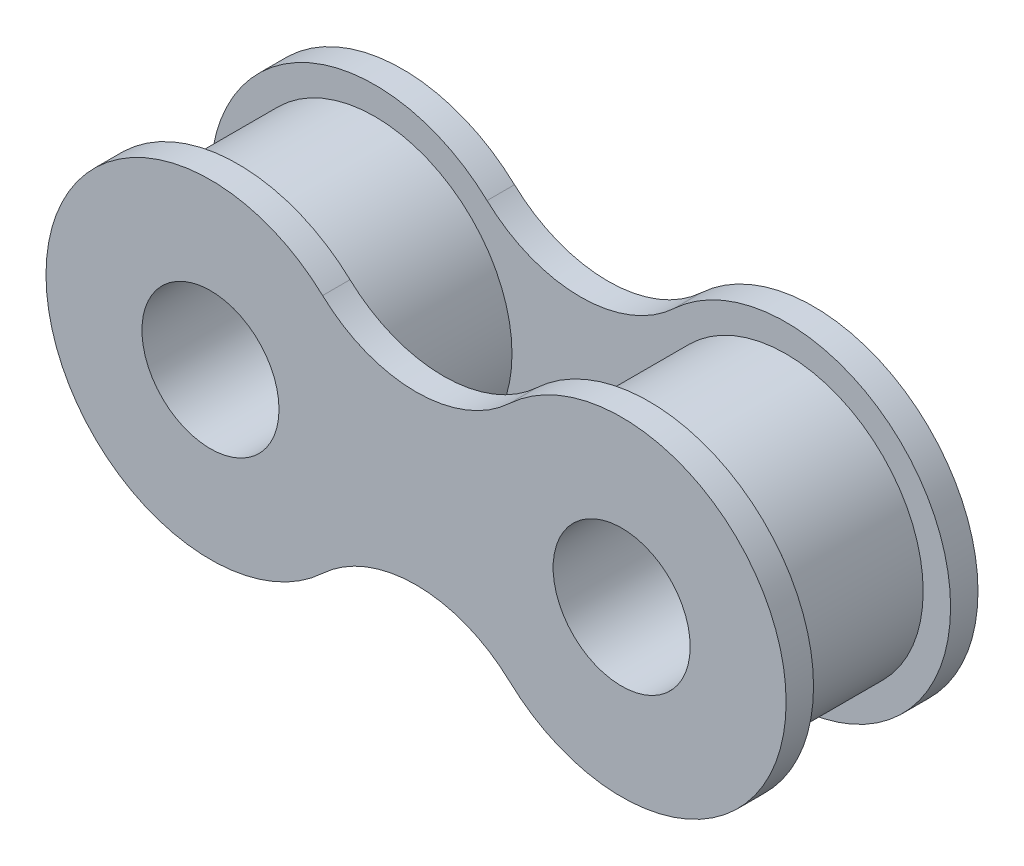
from build123d import *

# Parameters (mm, degrees)
LINEAR_AUSTRAGEN1_DEPTH        = 2.5
LINEAR_AUSTRAGEN1_DEPTH_BACK   = 2.5
SKIZZE1_R                      = 5
SKIZZE1_R_2                    = 2.5
LINEAR_AUSTRAGEN1_2_DEPTH      = 2.5
LINEAR_AUSTRAGEN1_2_DEPTH_BACK = 2.5
LINEAR_START                   = 2.5
SKIZZE1_3_R                    = 2.5
LINEAR_AUSTRAGEN2_DEPTH        = 1


with BuildPart() as part:
    # Skizze1 → Linear austragen1 (new, two sides: drawn at the far end of the back side and taken through both)
    with BuildSketch(Plane.XY.offset(-LINEAR_AUSTRAGEN1_DEPTH_BACK)):
        Circle(SKIZZE1_R)
        Circle(SKIZZE1_R_2, mode=Mode.SUBTRACT)
    extrude(amount=LINEAR_AUSTRAGEN1_DEPTH + LINEAR_AUSTRAGEN1_DEPTH_BACK)



with BuildPart() as body_2:
    # Skizze1 → Linear austragen1 2 (new, two sides: drawn at the far end of the back side and taken through both)
    with BuildSketch(Plane.XY.offset(-LINEAR_AUSTRAGEN1_2_DEPTH_BACK)):
        with Locations((15, 0)):
            Circle(SKIZZE1_R)
        with Locations((15, 0)):
            Circle(SKIZZE1_R_2, mode=Mode.SUBTRACT)
    extrude(amount=LINEAR_AUSTRAGEN1_2_DEPTH + LINEAR_AUSTRAGEN1_2_DEPTH_BACK)


with BuildPart() as part_1:
    add(part.part)

    add(body_2.part)  # Linear austragen2 merges body 2
    # Skizze1_3 → Linear austragen2 (add)
    with BuildSketch(Plane.XY.offset(LINEAR_START)):
        with BuildLine():
            ThreePointArc((4.090909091, 4.389130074), (-6, 0), (4.090909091, -4.389130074))
            ThreePointArc((4.090909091, -4.389130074), (7.5, -3.04673847), (10.909090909, -4.389130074))
            ThreePointArc((10.909090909, -4.389130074), (21, 0), (10.909090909, 4.389130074))
            ThreePointArc((10.909090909, 4.389130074), (7.5, 3.04673847), (4.090909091, 4.389130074))
        make_face()
        Circle(SKIZZE1_3_R, mode=Mode.SUBTRACT)
        with Locations((15, 0)):
            Circle(SKIZZE1_3_R, mode=Mode.SUBTRACT)
    linear_austragen2 = extrude(amount=LINEAR_AUSTRAGEN2_DEPTH)

    # Spiegeln1: Linear austragen2 across plane
    add(linear_austragen2.mirror(Plane.XY))


solid = part_1.part
